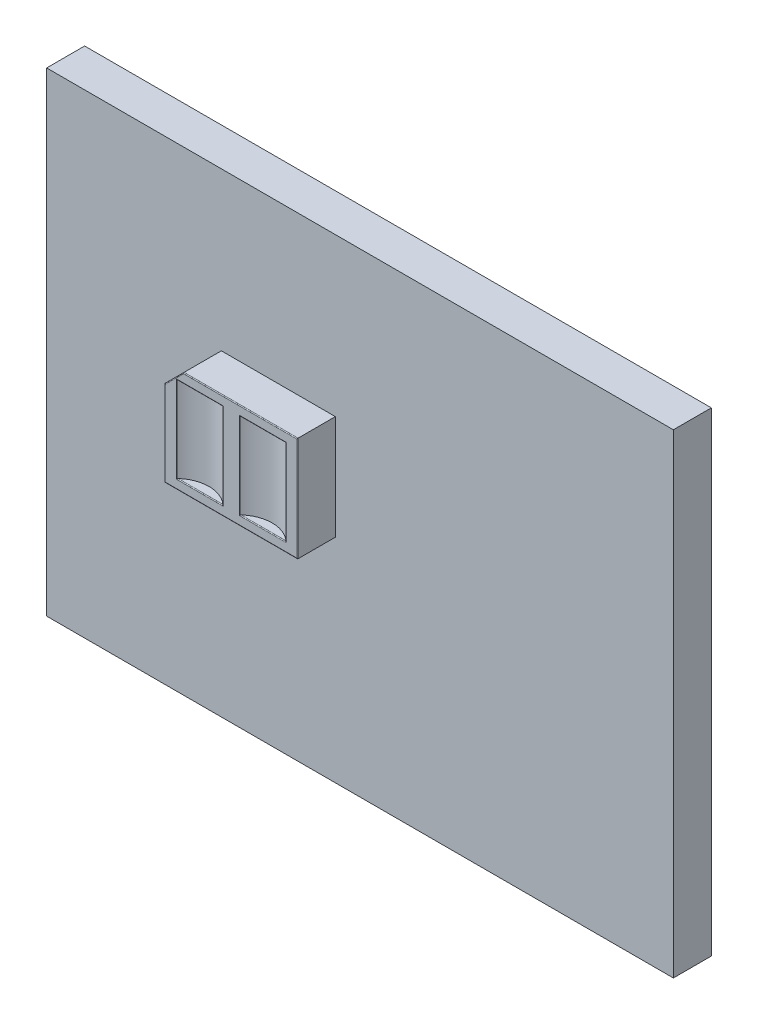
ISO-10303-21;
HEADER;
FILE_DESCRIPTION(('STEP AP214'),'2;1');
FILE_NAME('part.step','',(''),(''),'','','');
FILE_SCHEMA(('AUTOMOTIVE_DESIGN { 1 0 10303 214 1 1 1 1 }'));
ENDSEC;
DATA;
#1=APPLICATION_CONTEXT('core data for automotive mechanical design processes');
#2=APPLICATION_PROTOCOL_DEFINITION('international standard','automotive_design',2000,#1);
#3=PRODUCT_CONTEXT('',#1,'mechanical');
#4=PRODUCT('Part','Part','',(#3));
#5=PRODUCT_RELATED_PRODUCT_CATEGORY('part','',(#4));
#6=PRODUCT_DEFINITION_FORMATION('','',#4);
#7=PRODUCT_DEFINITION_CONTEXT('part definition',#1,'design');
#8=PRODUCT_DEFINITION('design','',#6,#7);
#9=PRODUCT_DEFINITION_SHAPE('','',#8);
#10=(LENGTH_UNIT() NAMED_UNIT(*) SI_UNIT(.MILLI.,.METRE.));
#11=(NAMED_UNIT(*) PLANE_ANGLE_UNIT() SI_UNIT($,.RADIAN.));
#12=(NAMED_UNIT(*) SI_UNIT($,.STERADIAN.) SOLID_ANGLE_UNIT());
#13=UNCERTAINTY_MEASURE_WITH_UNIT(LENGTH_MEASURE(1.E-05),#10,'distance_accuracy_value','');
#14=(GEOMETRIC_REPRESENTATION_CONTEXT(3) GLOBAL_UNCERTAINTY_ASSIGNED_CONTEXT((#13)) GLOBAL_UNIT_ASSIGNED_CONTEXT((#10,
#11,#12)) REPRESENTATION_CONTEXT('',''));
#15=CARTESIAN_POINT('',(0.,0.,0.));
#16=DIRECTION('',(0.,0.,1.));
#17=DIRECTION('',(1.,0.,0.));
#18=AXIS2_PLACEMENT_3D('',#15,#16,#17);
#19=CARTESIAN_POINT('',(-0.65,2.1,2.));
#20=DIRECTION('',(0.,0.,1.));
#21=DIRECTION('',(1.,0.,0.));
#22=AXIS2_PLACEMENT_3D('',#19,#20,#21);
#23=PLANE('',#22);
#24=DIRECTION('',(0.,1.,0.));
#25=VECTOR('',#24,1.);
#26=CARTESIAN_POINT('',(-2.59942700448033,-0.4,2.));
#27=LINE('',#26,#25);
#28=CARTESIAN_POINT('',(-2.59942700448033,1.87,2.));
#29=VERTEX_POINT('',#28);
#30=CARTESIAN_POINT('',(-2.59942700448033,-0.42,2.));
#31=VERTEX_POINT('',#30);
#32=EDGE_CURVE('E279',#29,#31,#27,.F.);
#33=ORIENTED_EDGE('',*,*,#32,.T.);
#34=DIRECTION('',(-1.,0.,0.));
#35=VECTOR('',#34,1.);
#36=CARTESIAN_POINT('',(-3.82761374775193,-0.42,2.));
#37=LINE('',#36,#35);
#38=CARTESIAN_POINT('',(-3.8355895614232,-0.42,2.));
#39=VERTEX_POINT('',#38);
#40=EDGE_CURVE('E281',#31,#39,#37,.T.);
#41=ORIENTED_EDGE('',*,*,#40,.T.);
#42=DIRECTION('',(0.,1.,0.));
#43=VECTOR('',#42,1.);
#44=CARTESIAN_POINT('',(-3.8355895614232,1.85,2.));
#45=LINE('',#44,#43);
#46=CARTESIAN_POINT('',(-3.8355895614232,1.87,2.));
#47=VERTEX_POINT('',#46);
#48=EDGE_CURVE('E275',#39,#47,#45,.T.);
#49=ORIENTED_EDGE('',*,*,#48,.T.);
#50=DIRECTION('',(-1.,0.,0.));
#51=VECTOR('',#50,1.);
#52=CARTESIAN_POINT('',(-0.65,1.87,2.));
#53=LINE('',#52,#51);
#54=EDGE_CURVE('E277',#47,#29,#53,.F.);
#55=ORIENTED_EDGE('',*,*,#54,.T.);
#56=EDGE_LOOP('',(#33,#41,#49,#55));
#57=FACE_BOUND('',#56,.T.);
#58=DIRECTION('',(0.,-1.,0.));
#59=VECTOR('',#58,1.);
#60=CARTESIAN_POINT('',(-4.13,-0.650000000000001,2.));
#61=LINE('',#60,#59);
#62=CARTESIAN_POINT('',(-4.13,1.59171572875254,2.));
#63=VERTEX_POINT('',#62);
#64=CARTESIAN_POINT('',(-4.13,-0.630000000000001,2.));
#65=VERTEX_POINT('',#64);
#66=EDGE_CURVE('E270',#63,#65,#61,.T.);
#67=ORIENTED_EDGE('',*,*,#66,.T.);
#68=DIRECTION('',(1.,0.,0.));
#69=VECTOR('',#68,1.);
#70=CARTESIAN_POINT('',(-0.65,-0.63,2.));
#71=LINE('',#70,#69);
#72=CARTESIAN_POINT('',(-0.67,-0.63,2.));
#73=VERTEX_POINT('',#72);
#74=EDGE_CURVE('E272',#65,#73,#71,.T.);
#75=ORIENTED_EDGE('',*,*,#74,.T.);
#76=DIRECTION('',(0.,1.,0.));
#77=VECTOR('',#76,1.);
#78=CARTESIAN_POINT('',(-0.67,2.1,2.));
#79=LINE('',#78,#77);
#80=CARTESIAN_POINT('',(-0.67,2.08,2.));
#81=VERTEX_POINT('',#80);
#82=EDGE_CURVE('E264',#73,#81,#79,.T.);
#83=ORIENTED_EDGE('',*,*,#82,.T.);
#84=DIRECTION('',(-1.,0.,0.));
#85=VECTOR('',#84,1.);
#86=CARTESIAN_POINT('',(-3.65,2.08,2.));
#87=LINE('',#86,#85);
#88=CARTESIAN_POINT('',(-3.64171572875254,2.08,2.));
#89=VERTEX_POINT('',#88);
#90=EDGE_CURVE('E266',#81,#89,#87,.T.);
#91=ORIENTED_EDGE('',*,*,#90,.T.);
#92=DIRECTION('',(-0.707106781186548,-0.707106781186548,0.));
#93=VECTOR('',#92,1.);
#94=CARTESIAN_POINT('',(-4.13585786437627,1.58585786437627,2.));
#95=LINE('',#94,#93);
#96=EDGE_CURVE('E268',#89,#63,#95,.T.);
#97=ORIENTED_EDGE('',*,*,#96,.T.);
#98=EDGE_LOOP('',(#67,#75,#83,#91,#97));
#99=FACE_BOUND('',#98,.T.);
#100=DIRECTION('',(-1.,0.,0.));
#101=VECTOR('',#100,1.);
#102=CARTESIAN_POINT('',(-0.65,-0.42,2.));
#103=LINE('',#102,#101);
#104=CARTESIAN_POINT('',(-0.940013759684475,-0.42,2.));
#105=VERTEX_POINT('',#104);
#106=CARTESIAN_POINT('',(-2.17617631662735,-0.42,2.));
#107=VERTEX_POINT('',#106);
#108=EDGE_CURVE('E259',#105,#107,#103,.T.);
#109=ORIENTED_EDGE('',*,*,#108,.T.);
#110=DIRECTION('',(0.,1.,0.));
#111=VECTOR('',#110,1.);
#112=CARTESIAN_POINT('',(-2.17617631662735,1.85,2.));
#113=LINE('',#112,#111);
#114=CARTESIAN_POINT('',(-2.17617631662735,1.87,2.));
#115=VERTEX_POINT('',#114);
#116=EDGE_CURVE('E261',#107,#115,#113,.T.);
#117=ORIENTED_EDGE('',*,*,#116,.T.);
#118=DIRECTION('',(-1.,0.,0.));
#119=VECTOR('',#118,1.);
#120=CARTESIAN_POINT('',(-0.947989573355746,1.87,2.));
#121=LINE('',#120,#119);
#122=CARTESIAN_POINT('',(-0.940013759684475,1.87,2.));
#123=VERTEX_POINT('',#122);
#124=EDGE_CURVE('E255',#115,#123,#121,.F.);
#125=ORIENTED_EDGE('',*,*,#124,.T.);
#126=DIRECTION('',(0.,1.,0.));
#127=VECTOR('',#126,1.);
#128=CARTESIAN_POINT('',(-0.940013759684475,-0.4,2.));
#129=LINE('',#128,#127);
#130=EDGE_CURVE('E257',#123,#105,#129,.F.);
#131=ORIENTED_EDGE('',*,*,#130,.T.);
#132=EDGE_LOOP('',(#109,#117,#125,#131));
#133=FACE_BOUND('',#132,.T.);
#134=ADVANCED_FACE('F31',(#57,#99,#133),#23,.T.);
#135=CARTESIAN_POINT('',(-8.25,-6.25,1.));
#136=DIRECTION('',(0.,0.,1.));
#137=DIRECTION('',(1.,0.,0.));
#138=AXIS2_PLACEMENT_3D('',#135,#136,#137);
#139=PLANE('',#138);
#140=DIRECTION('',(0.,-1.,0.));
#141=VECTOR('',#140,1.);
#142=CARTESIAN_POINT('',(-8.25,6.25,1.));
#143=LINE('',#142,#141);
#144=CARTESIAN_POINT('',(-8.25,6.25,1.));
#145=VERTEX_POINT('',#144);
#146=CARTESIAN_POINT('',(-8.25,-6.25,1.));
#147=VERTEX_POINT('',#146);
#148=EDGE_CURVE('E234',#145,#147,#143,.T.);
#149=ORIENTED_EDGE('',*,*,#148,.T.);
#150=DIRECTION('',(1.,0.,0.));
#151=VECTOR('',#150,1.);
#152=CARTESIAN_POINT('',(-8.25,-6.25,1.));
#153=LINE('',#152,#151);
#154=CARTESIAN_POINT('',(8.25,-6.25,1.));
#155=VERTEX_POINT('',#154);
#156=EDGE_CURVE('E237',#147,#155,#153,.T.);
#157=ORIENTED_EDGE('',*,*,#156,.T.);
#158=DIRECTION('',(0.,1.,0.));
#159=VECTOR('',#158,1.);
#160=CARTESIAN_POINT('',(8.25,6.25,1.));
#161=LINE('',#160,#159);
#162=CARTESIAN_POINT('',(8.25,6.25,1.));
#163=VERTEX_POINT('',#162);
#164=EDGE_CURVE('E239',#155,#163,#161,.T.);
#165=ORIENTED_EDGE('',*,*,#164,.T.);
#166=DIRECTION('',(-1.,0.,0.));
#167=VECTOR('',#166,1.);
#168=CARTESIAN_POINT('',(-8.25,6.25,1.));
#169=LINE('',#168,#167);
#170=EDGE_CURVE('E241',#163,#145,#169,.T.);
#171=ORIENTED_EDGE('',*,*,#170,.T.);
#172=EDGE_LOOP('',(#149,#157,#165,#171));
#173=FACE_BOUND('',#172,.T.);
#174=DIRECTION('',(1.,0.,0.));
#175=VECTOR('',#174,1.);
#176=CARTESIAN_POINT('',(-8.25,2.1,1.));
#177=LINE('',#176,#175);
#178=CARTESIAN_POINT('',(-3.65,2.1,1.));
#179=VERTEX_POINT('',#178);
#180=CARTESIAN_POINT('',(-0.65,2.1,1.));
#181=VERTEX_POINT('',#180);
#182=EDGE_CURVE('E219',#179,#181,#177,.T.);
#183=ORIENTED_EDGE('',*,*,#182,.T.);
#184=DIRECTION('',(0.,-1.,0.));
#185=VECTOR('',#184,1.);
#186=CARTESIAN_POINT('',(-0.65,-6.25,1.));
#187=LINE('',#186,#185);
#188=CARTESIAN_POINT('',(-0.65,-0.65,1.));
#189=VERTEX_POINT('',#188);
#190=EDGE_CURVE('E196',#181,#189,#187,.T.);
#191=ORIENTED_EDGE('',*,*,#190,.T.);
#192=DIRECTION('',(-1.,0.,0.));
#193=VECTOR('',#192,1.);
#194=CARTESIAN_POINT('',(-8.25,-0.650000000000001,1.));
#195=LINE('',#194,#193);
#196=CARTESIAN_POINT('',(-4.15,-0.650000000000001,1.));
#197=VERTEX_POINT('',#196);
#198=EDGE_CURVE('E207',#189,#197,#195,.T.);
#199=ORIENTED_EDGE('',*,*,#198,.T.);
#200=DIRECTION('',(0.,1.,0.));
#201=VECTOR('',#200,1.);
#202=CARTESIAN_POINT('',(-4.15,-6.25,1.));
#203=LINE('',#202,#201);
#204=CARTESIAN_POINT('',(-4.15,1.6,1.));
#205=VERTEX_POINT('',#204);
#206=EDGE_CURVE('E213',#197,#205,#203,.T.);
#207=ORIENTED_EDGE('',*,*,#206,.T.);
#208=DIRECTION('',(0.707106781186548,0.707106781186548,0.));
#209=VECTOR('',#208,1.);
#210=CARTESIAN_POINT('',(-10.125,-4.375,1.));
#211=LINE('',#210,#209);
#212=EDGE_CURVE('E225',#205,#179,#211,.T.);
#213=ORIENTED_EDGE('',*,*,#212,.T.);
#214=EDGE_LOOP('',(#183,#191,#199,#207,#213));
#215=FACE_BOUND('',#214,.T.);
#216=ADVANCED_FACE('F216',(#173,#215),#139,.T.);
#217=CARTESIAN_POINT('',(-8.25,6.25,1.));
#218=DIRECTION('',(1.,0.,0.));
#219=DIRECTION('',(0.,0.,-1.));
#220=AXIS2_PLACEMENT_3D('',#217,#218,#219);
#221=PLANE('',#220);
#222=DIRECTION('',(0.,-1.,0.));
#223=VECTOR('',#222,1.);
#224=CARTESIAN_POINT('',(-8.25,6.25,0.));
#225=LINE('',#224,#223);
#226=CARTESIAN_POINT('',(-8.25,6.25,0.));
#227=VERTEX_POINT('',#226);
#228=CARTESIAN_POINT('',(-8.25,-6.25,0.));
#229=VERTEX_POINT('',#228);
#230=EDGE_CURVE('E220',#227,#229,#225,.T.);
#231=ORIENTED_EDGE('',*,*,#230,.T.);
#232=DIRECTION('',(0.,0.,-1.));
#233=VECTOR('',#232,1.);
#234=CARTESIAN_POINT('',(-8.25,-6.25,1.));
#235=LINE('',#234,#233);
#236=EDGE_CURVE('E252',#147,#229,#235,.T.);
#237=ORIENTED_EDGE('',*,*,#236,.F.);
#238=ORIENTED_EDGE('',*,*,#148,.F.);
#239=DIRECTION('',(0.,0.,-1.));
#240=VECTOR('',#239,1.);
#241=CARTESIAN_POINT('',(-8.25,6.25,1.));
#242=LINE('',#241,#240);
#243=EDGE_CURVE('E243',#145,#227,#242,.T.);
#244=ORIENTED_EDGE('',*,*,#243,.T.);
#245=EDGE_LOOP('',(#231,#237,#238,#244));
#246=FACE_BOUND('',#245,.T.);
#247=ADVANCED_FACE('F33',(#246),#221,.F.);
#248=CARTESIAN_POINT('',(-8.25,-6.25,1.));
#249=DIRECTION('',(0.,1.,0.));
#250=DIRECTION('',(0.,0.,1.));
#251=AXIS2_PLACEMENT_3D('',#248,#249,#250);
#252=PLANE('',#251);
#253=DIRECTION('',(1.,0.,0.));
#254=VECTOR('',#253,1.);
#255=CARTESIAN_POINT('',(-8.25,-6.25,0.));
#256=LINE('',#255,#254);
#257=CARTESIAN_POINT('',(8.25,-6.25,0.));
#258=VERTEX_POINT('',#257);
#259=EDGE_CURVE('E223',#229,#258,#256,.T.);
#260=ORIENTED_EDGE('',*,*,#259,.T.);
#261=DIRECTION('',(0.,0.,-1.));
#262=VECTOR('',#261,1.);
#263=CARTESIAN_POINT('',(8.25,-6.25,1.));
#264=LINE('',#263,#262);
#265=EDGE_CURVE('E249',#155,#258,#264,.T.);
#266=ORIENTED_EDGE('',*,*,#265,.F.);
#267=ORIENTED_EDGE('',*,*,#156,.F.);
#268=ORIENTED_EDGE('',*,*,#236,.T.);
#269=EDGE_LOOP('',(#260,#266,#267,#268));
#270=FACE_BOUND('',#269,.T.);
#271=ADVANCED_FACE('F663',(#270),#252,.F.);
#272=CARTESIAN_POINT('',(8.25,6.25,1.));
#273=DIRECTION('',(-1.,0.,0.));
#274=DIRECTION('',(0.,0.,1.));
#275=AXIS2_PLACEMENT_3D('',#272,#273,#274);
#276=PLANE('',#275);
#277=DIRECTION('',(0.,1.,0.));
#278=VECTOR('',#277,1.);
#279=CARTESIAN_POINT('',(8.25,6.25,0.));
#280=LINE('',#279,#278);
#281=CARTESIAN_POINT('',(8.25,6.25,0.));
#282=VERTEX_POINT('',#281);
#283=EDGE_CURVE('E230',#258,#282,#280,.T.);
#284=ORIENTED_EDGE('',*,*,#283,.T.);
#285=DIRECTION('',(0.,0.,-1.));
#286=VECTOR('',#285,1.);
#287=CARTESIAN_POINT('',(8.25,6.25,1.));
#288=LINE('',#287,#286);
#289=EDGE_CURVE('E246',#163,#282,#288,.T.);
#290=ORIENTED_EDGE('',*,*,#289,.F.);
#291=ORIENTED_EDGE('',*,*,#164,.F.);
#292=ORIENTED_EDGE('',*,*,#265,.T.);
#293=EDGE_LOOP('',(#284,#290,#291,#292));
#294=FACE_BOUND('',#293,.T.);
#295=ADVANCED_FACE('F653',(#294),#276,.F.);
#296=CARTESIAN_POINT('',(-8.25,6.25,1.));
#297=DIRECTION('',(0.,-1.,0.));
#298=DIRECTION('',(0.,0.,-1.));
#299=AXIS2_PLACEMENT_3D('',#296,#297,#298);
#300=PLANE('',#299);
#301=DIRECTION('',(-1.,0.,0.));
#302=VECTOR('',#301,1.);
#303=CARTESIAN_POINT('',(-8.25,6.25,0.));
#304=LINE('',#303,#302);
#305=EDGE_CURVE('E232',#282,#227,#304,.T.);
#306=ORIENTED_EDGE('',*,*,#305,.T.);
#307=ORIENTED_EDGE('',*,*,#243,.F.);
#308=ORIENTED_EDGE('',*,*,#170,.F.);
#309=ORIENTED_EDGE('',*,*,#289,.T.);
#310=EDGE_LOOP('',(#306,#307,#308,#309));
#311=FACE_BOUND('',#310,.T.);
#312=ADVANCED_FACE('F635',(#311),#300,.F.);
#313=CARTESIAN_POINT('',(-8.25,-6.25,0.));
#314=DIRECTION('',(0.,0.,1.));
#315=DIRECTION('',(1.,0.,0.));
#316=AXIS2_PLACEMENT_3D('',#313,#314,#315);
#317=PLANE('',#316);
#318=ORIENTED_EDGE('',*,*,#230,.F.);
#319=ORIENTED_EDGE('',*,*,#305,.F.);
#320=ORIENTED_EDGE('',*,*,#283,.F.);
#321=ORIENTED_EDGE('',*,*,#259,.F.);
#322=EDGE_LOOP('',(#318,#319,#320,#321));
#323=FACE_BOUND('',#322,.T.);
#324=ADVANCED_FACE('F619',(#323),#317,.F.);
#325=CARTESIAN_POINT('',(-0.65,2.1,2.));
#326=DIRECTION('',(-1.,0.,0.));
#327=DIRECTION('',(0.,0.,1.));
#328=AXIS2_PLACEMENT_3D('',#325,#326,#327);
#329=PLANE('',#328);
#330=DIRECTION('',(0.,0.,-1.));
#331=VECTOR('',#330,1.);
#332=CARTESIAN_POINT('',(-0.65,2.1,2.));
#333=LINE('',#332,#331);
#334=CARTESIAN_POINT('',(-0.65,2.1,1.98));
#335=VERTEX_POINT('',#334);
#336=EDGE_CURVE('E214',#335,#181,#333,.T.);
#337=ORIENTED_EDGE('',*,*,#336,.F.);
#338=DIRECTION('',(0.,1.,0.));
#339=VECTOR('',#338,1.);
#340=CARTESIAN_POINT('',(-0.65,-0.65,1.98));
#341=LINE('',#340,#339);
#342=CARTESIAN_POINT('',(-0.65,-0.65,1.98));
#343=VERTEX_POINT('',#342);
#344=EDGE_CURVE('E199',#335,#343,#341,.F.);
#345=ORIENTED_EDGE('',*,*,#344,.T.);
#346=DIRECTION('',(0.,0.,-1.));
#347=VECTOR('',#346,1.);
#348=CARTESIAN_POINT('',(-0.65,-0.65,2.));
#349=LINE('',#348,#347);
#350=EDGE_CURVE('E191',#343,#189,#349,.T.);
#351=ORIENTED_EDGE('',*,*,#350,.T.);
#352=ORIENTED_EDGE('',*,*,#190,.F.);
#353=EDGE_LOOP('',(#337,#345,#351,#352));
#354=FACE_BOUND('',#353,.T.);
#355=ADVANCED_FACE('F194',(#354),#329,.F.);
#356=CARTESIAN_POINT('',(-3.65,2.1,2.));
#357=DIRECTION('',(0.,-1.,0.));
#358=DIRECTION('',(0.,0.,-1.));
#359=AXIS2_PLACEMENT_3D('',#356,#357,#358);
#360=PLANE('',#359);
#361=DIRECTION('',(0.,0.,-1.));
#362=VECTOR('',#361,1.);
#363=CARTESIAN_POINT('',(-3.65,2.1,2.));
#364=LINE('',#363,#362);
#365=CARTESIAN_POINT('',(-3.65,2.1,1.98));
#366=VERTEX_POINT('',#365);
#367=EDGE_CURVE('E450',#366,#179,#364,.T.);
#368=ORIENTED_EDGE('',*,*,#367,.F.);
#369=DIRECTION('',(-1.,0.,0.));
#370=VECTOR('',#369,1.);
#371=CARTESIAN_POINT('',(-0.65,2.1,1.98));
#372=LINE('',#371,#370);
#373=EDGE_CURVE('E299',#366,#335,#372,.F.);
#374=ORIENTED_EDGE('',*,*,#373,.T.);
#375=ORIENTED_EDGE('',*,*,#336,.T.);
#376=ORIENTED_EDGE('',*,*,#182,.F.);
#377=EDGE_LOOP('',(#368,#374,#375,#376));
#378=FACE_BOUND('',#377,.T.);
#379=ADVANCED_FACE('F461',(#378),#360,.F.);
#380=CARTESIAN_POINT('',(-4.15,1.6,2.));
#381=DIRECTION('',(0.707106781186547,-0.707106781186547,0.));
#382=DIRECTION('',(0.707106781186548,0.707106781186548,0.));
#383=AXIS2_PLACEMENT_3D('',#380,#381,#382);
#384=PLANE('',#383);
#385=DIRECTION('',(0.,0.,-1.));
#386=VECTOR('',#385,1.);
#387=CARTESIAN_POINT('',(-4.15,1.6,2.));
#388=LINE('',#387,#386);
#389=CARTESIAN_POINT('',(-4.15,1.6,1.98));
#390=VERTEX_POINT('',#389);
#391=EDGE_CURVE('E448',#390,#205,#388,.T.);
#392=ORIENTED_EDGE('',*,*,#391,.F.);
#393=DIRECTION('',(-0.707106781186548,-0.707106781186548,0.));
#394=VECTOR('',#393,1.);
#395=CARTESIAN_POINT('',(-3.65,2.1,1.98));
#396=LINE('',#395,#394);
#397=EDGE_CURVE('E297',#390,#366,#396,.F.);
#398=ORIENTED_EDGE('',*,*,#397,.T.);
#399=ORIENTED_EDGE('',*,*,#367,.T.);
#400=ORIENTED_EDGE('',*,*,#212,.F.);
#401=EDGE_LOOP('',(#392,#398,#399,#400));
#402=FACE_BOUND('',#401,.T.);
#403=ADVANCED_FACE('F456',(#402),#384,.F.);
#404=CARTESIAN_POINT('',(-4.15,-0.650000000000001,2.));
#405=DIRECTION('',(1.,0.,0.));
#406=DIRECTION('',(0.,0.,-1.));
#407=AXIS2_PLACEMENT_3D('',#404,#405,#406);
#408=PLANE('',#407);
#409=DIRECTION('',(0.,0.,-1.));
#410=VECTOR('',#409,1.);
#411=CARTESIAN_POINT('',(-4.15,-0.650000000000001,2.));
#412=LINE('',#411,#410);
#413=CARTESIAN_POINT('',(-4.15,-0.650000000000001,1.98));
#414=VERTEX_POINT('',#413);
#415=EDGE_CURVE('E203',#414,#197,#412,.T.);
#416=ORIENTED_EDGE('',*,*,#415,.F.);
#417=DIRECTION('',(0.,-1.,0.));
#418=VECTOR('',#417,1.);
#419=CARTESIAN_POINT('',(-4.15,1.6,1.98));
#420=LINE('',#419,#418);
#421=EDGE_CURVE('E295',#414,#390,#420,.F.);
#422=ORIENTED_EDGE('',*,*,#421,.T.);
#423=ORIENTED_EDGE('',*,*,#391,.T.);
#424=ORIENTED_EDGE('',*,*,#206,.F.);
#425=EDGE_LOOP('',(#416,#422,#423,#424));
#426=FACE_BOUND('',#425,.T.);
#427=ADVANCED_FACE('F477',(#426),#408,.F.);
#428=CARTESIAN_POINT('',(-0.65,-0.65,2.));
#429=DIRECTION('',(0.,1.,0.));
#430=DIRECTION('',(-1.,0.,0.));
#431=AXIS2_PLACEMENT_3D('',#428,#429,#430);
#432=PLANE('',#431);
#433=ORIENTED_EDGE('',*,*,#350,.F.);
#434=DIRECTION('',(1.,0.,0.));
#435=VECTOR('',#434,1.);
#436=CARTESIAN_POINT('',(-4.15,-0.650000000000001,1.98));
#437=LINE('',#436,#435);
#438=EDGE_CURVE('E293',#343,#414,#437,.F.);
#439=ORIENTED_EDGE('',*,*,#438,.T.);
#440=ORIENTED_EDGE('',*,*,#415,.T.);
#441=ORIENTED_EDGE('',*,*,#198,.F.);
#442=EDGE_LOOP('',(#433,#439,#440,#441));
#443=FACE_BOUND('',#442,.T.);
#444=ADVANCED_FACE('F208',(#443),#432,.F.);
#445=CARTESIAN_POINT('',(-3.21750828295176,1.85,2.63752959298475));
#446=DIRECTION('',(0.,-1.,0.));
#447=DIRECTION('',(0.,0.,-1.));
#448=AXIS2_PLACEMENT_3D('',#445,#446,#447);
#449=CYLINDRICAL_SURFACE('',#448,0.882424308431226);
#450=CARTESIAN_POINT('',(-2.62901232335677,-0.4,1.98));
#451=CARTESIAN_POINT('',(-2.6272001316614,-0.400004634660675,1.981621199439));
#452=CARTESIAN_POINT('',(-2.62538571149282,-0.400198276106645,1.98325934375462));
#453=CARTESIAN_POINT('',(-2.62187863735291,-0.40099829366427,1.98645110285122));
#454=CARTESIAN_POINT('',(-2.62018395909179,-0.40159196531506,1.98800577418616));
#455=CARTESIAN_POINT('',(-2.61759664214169,-0.402885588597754,1.99039714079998));
#456=CARTESIAN_POINT('',(-2.61666159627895,-0.403440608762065,1.99126539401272));
#457=CARTESIAN_POINT('',(-2.6148428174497,-0.404730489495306,1.99296106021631));
#458=CARTESIAN_POINT('',(-2.61396033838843,-0.405468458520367,1.99378743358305));
#459=CARTESIAN_POINT('',(-2.61312524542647,-0.406301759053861,1.9945725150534));
#460=B_SPLINE_CURVE_WITH_KNOTS('',3,(#450,#451,#452,#453,#454,#455,#456,#457,#458,#459),
.UNSPECIFIED.,.F.,.F.,(4,2,2,2,4),(0.,0.00730858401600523,0.0143953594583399,0.0185579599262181,
0.0227968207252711),.UNSPECIFIED.);
#461=CARTESIAN_POINT('',(-2.62901232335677,-0.4,1.98));
#462=VERTEX_POINT('',#461);
#463=CARTESIAN_POINT('',(-2.61312524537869,-0.406301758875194,1.99457251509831));
#464=VERTEX_POINT('',#463);
#465=EDGE_CURVE('E316',#462,#464,#460,.T.);
#466=ORIENTED_EDGE('',*,*,#465,.T.);
#467=DIRECTION('',(0.,-1.,0.));
#468=VECTOR('',#467,1.);
#469=CARTESIAN_POINT('',(-2.61312524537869,1.85,1.99457251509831));
#470=LINE('',#469,#468);
#471=CARTESIAN_POINT('',(-2.61312524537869,1.85630175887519,1.99457251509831));
#472=VERTEX_POINT('',#471);
#473=EDGE_CURVE('E289',#464,#472,#470,.F.);
#474=ORIENTED_EDGE('',*,*,#473,.T.);
#475=CARTESIAN_POINT('',(-2.61312524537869,1.85630175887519,1.99457251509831));
#476=CARTESIAN_POINT('',(-2.61414134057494,1.85528984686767,1.99361714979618));
#477=CARTESIAN_POINT('',(-2.61522530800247,1.85441776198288,1.99260297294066));
#478=CARTESIAN_POINT('',(-2.61746513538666,1.85294195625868,1.99051869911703));
#479=CARTESIAN_POINT('',(-2.61861900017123,1.85233296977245,1.98945022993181));
#480=CARTESIAN_POINT('',(-2.62125844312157,1.85121416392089,1.98702000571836));
#481=CARTESIAN_POINT('',(-2.62275825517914,1.85076127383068,1.98564833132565));
#482=CARTESIAN_POINT('',(-2.62584154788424,1.85015153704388,1.98284822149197));
#483=CARTESIAN_POINT('',(-2.62742619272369,1.8500028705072,1.98141924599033));
#484=CARTESIAN_POINT('',(-2.62901232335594,1.84999999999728,1.98000000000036));
#485=B_SPLINE_CURVE_WITH_KNOTS('',3,(#475,#476,#477,#478,#479,#480,#481,#482,#483,#484),
.UNSPECIFIED.,.F.,.F.,(4,2,2,2,4),(0.,0.00514761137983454,0.0101867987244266,0.0164101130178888,
0.0227986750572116),.UNSPECIFIED.);
#486=CARTESIAN_POINT('',(-2.62901232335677,1.85,1.98));
#487=VERTEX_POINT('',#486);
#488=EDGE_CURVE('E355',#472,#487,#485,.T.);
#489=ORIENTED_EDGE('',*,*,#488,.T.);
#490=CARTESIAN_POINT('',(-3.21750828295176,1.85,2.63752959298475));
#491=DIRECTION('',(0.,-1.,0.));
#492=DIRECTION('',(0.,0.,-1.));
#493=AXIS2_PLACEMENT_3D('',#490,#491,#492);
#494=CIRCLE('',#493,0.882424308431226);
#495=CARTESIAN_POINT('',(-3.80600424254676,1.85,1.98));
#496=VERTEX_POINT('',#495);
#497=EDGE_CURVE('E204',#496,#487,#494,.T.);
#498=ORIENTED_EDGE('',*,*,#497,.F.);
#499=CARTESIAN_POINT('',(-3.80600424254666,1.85,1.97999999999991));
#500=CARTESIAN_POINT('',(-3.80781643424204,1.85000463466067,1.98162119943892));
#501=CARTESIAN_POINT('',(-3.80963085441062,1.85019827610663,1.98325934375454));
#502=CARTESIAN_POINT('',(-3.81313792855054,1.85099829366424,1.98645110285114));
#503=CARTESIAN_POINT('',(-3.81483260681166,1.85159196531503,1.98800577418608));
#504=CARTESIAN_POINT('',(-3.81741992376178,1.85288558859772,1.99039714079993));
#505=CARTESIAN_POINT('',(-3.81835496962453,1.85344060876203,1.99126539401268));
#506=CARTESIAN_POINT('',(-3.8201737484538,1.85473048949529,1.99296106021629));
#507=CARTESIAN_POINT('',(-3.82105622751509,1.85546845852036,1.99378743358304));
#508=CARTESIAN_POINT('',(-3.82189132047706,1.85630175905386,1.9945725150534));
#509=B_SPLINE_CURVE_WITH_KNOTS('',3,(#499,#500,#501,#502,#503,#504,#505,#506,#507,#508),
.UNSPECIFIED.,.F.,.F.,(4,2,2,2,4),(0.,0.00730858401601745,0.0143953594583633,0.0185579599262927,
0.0227968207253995),.UNSPECIFIED.);
#510=CARTESIAN_POINT('',(-3.82189132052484,1.85630175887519,1.99457251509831));
#511=VERTEX_POINT('',#510);
#512=EDGE_CURVE('E350',#496,#511,#509,.T.);
#513=ORIENTED_EDGE('',*,*,#512,.T.);
#514=DIRECTION('',(0.,-1.,0.));
#515=VECTOR('',#514,1.);
#516=CARTESIAN_POINT('',(-3.82189132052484,1.85,1.99457251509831));
#517=LINE('',#516,#515);
#518=CARTESIAN_POINT('',(-3.82189132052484,-0.406301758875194,1.99457251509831));
#519=VERTEX_POINT('',#518);
#520=EDGE_CURVE('E287',#511,#519,#517,.T.);
#521=ORIENTED_EDGE('',*,*,#520,.T.);
#522=CARTESIAN_POINT('',(-3.82189132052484,-0.406301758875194,1.99457251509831));
#523=CARTESIAN_POINT('',(-3.82087522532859,-0.405289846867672,1.99361714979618));
#524=CARTESIAN_POINT('',(-3.81979125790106,-0.404417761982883,1.99260297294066));
#525=CARTESIAN_POINT('',(-3.81755143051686,-0.402941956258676,1.99051869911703));
#526=CARTESIAN_POINT('',(-3.8163975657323,-0.402332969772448,1.98945022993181));
#527=CARTESIAN_POINT('',(-3.81375812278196,-0.401214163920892,1.98702000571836));
#528=CARTESIAN_POINT('',(-3.81225831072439,-0.400761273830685,1.98564833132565));
#529=CARTESIAN_POINT('',(-3.80917501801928,-0.400151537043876,1.98284822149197));
#530=CARTESIAN_POINT('',(-3.80759037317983,-0.4000028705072,1.98141924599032));
#531=CARTESIAN_POINT('',(-3.80600424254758,-0.399999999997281,1.98000000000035));
#532=B_SPLINE_CURVE_WITH_KNOTS('',3,(#522,#523,#524,#525,#526,#527,#528,#529,#530,#531),
.UNSPECIFIED.,.F.,.F.,(4,2,2,2,4),(0.,0.00514761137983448,0.0101867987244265,0.0164101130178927,
0.0227986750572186),.UNSPECIFIED.);
#533=CARTESIAN_POINT('',(-3.80600424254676,-0.4,1.98));
#534=VERTEX_POINT('',#533);
#535=EDGE_CURVE('E309',#519,#534,#532,.T.);
#536=ORIENTED_EDGE('',*,*,#535,.T.);
#537=CARTESIAN_POINT('',(-3.21750828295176,-0.4,2.63752959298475));
#538=DIRECTION('',(0.,-1.,0.));
#539=DIRECTION('',(0.,0.,-1.));
#540=AXIS2_PLACEMENT_3D('',#537,#538,#539);
#541=CIRCLE('',#540,0.882424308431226);
#542=EDGE_CURVE('E442',#534,#462,#541,.T.);
#543=ORIENTED_EDGE('',*,*,#542,.T.);
#544=EDGE_LOOP('',(#466,#474,#489,#498,#513,#521,#536,#543));
#545=FACE_BOUND('',#544,.T.);
#546=ADVANCED_FACE('F321',(#545),#449,.F.);
#547=CARTESIAN_POINT('',(-3.21750828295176,1.85,2.63752959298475));
#548=DIRECTION('',(0.,-1.,0.));
#549=DIRECTION('',(0.,0.,-1.));
#550=AXIS2_PLACEMENT_3D('',#547,#548,#549);
#551=PLANE('',#550);
#552=ORIENTED_EDGE('',*,*,#497,.T.);
#553=DIRECTION('',(-1.,0.,0.));
#554=VECTOR('',#553,1.);
#555=CARTESIAN_POINT('',(-3.21750828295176,1.85,1.98));
#556=LINE('',#555,#554);
#557=EDGE_CURVE('E291',#487,#496,#556,.T.);
#558=ORIENTED_EDGE('',*,*,#557,.T.);
#559=EDGE_LOOP('',(#552,#558));
#560=FACE_BOUND('',#559,.T.);
#561=ADVANCED_FACE('F561',(#560),#551,.T.);
#562=CARTESIAN_POINT('',(-3.21750828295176,-0.4,2.63752959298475));
#563=DIRECTION('',(0.,-1.,0.));
#564=DIRECTION('',(0.,0.,-1.));
#565=AXIS2_PLACEMENT_3D('',#562,#563,#564);
#566=PLANE('',#565);
#567=ORIENTED_EDGE('',*,*,#542,.F.);
#568=DIRECTION('',(-1.,0.,0.));
#569=VECTOR('',#568,1.);
#570=CARTESIAN_POINT('',(-2.6074028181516,-0.4,1.98));
#571=LINE('',#570,#569);
#572=EDGE_CURVE('E284',#534,#462,#571,.F.);
#573=ORIENTED_EDGE('',*,*,#572,.T.);
#574=EDGE_LOOP('',(#567,#573));
#575=FACE_BOUND('',#574,.T.);
#576=ADVANCED_FACE('F503',(#575),#566,.F.);
#577=CARTESIAN_POINT('',(-1.55809503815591,1.85,2.63752959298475));
#578=DIRECTION('',(0.,-1.,0.));
#579=DIRECTION('',(0.,0.,-1.));
#580=AXIS2_PLACEMENT_3D('',#577,#578,#579);
#581=CYLINDRICAL_SURFACE('',#580,0.882424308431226);
#582=CARTESIAN_POINT('',(-1.55809503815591,1.85,2.63752959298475));
#583=DIRECTION('',(0.,-1.,0.));
#584=DIRECTION('',(0.,0.,1.));
#585=AXIS2_PLACEMENT_3D('',#582,#583,#584);
#586=CIRCLE('',#585,0.882424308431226);
#587=CARTESIAN_POINT('',(-2.14659099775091,1.85,1.98));
#588=VERTEX_POINT('',#587);
#589=CARTESIAN_POINT('',(-0.969599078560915,1.85,1.98));
#590=VERTEX_POINT('',#589);
#591=EDGE_CURVE('E439',#588,#590,#586,.T.);
#592=ORIENTED_EDGE('',*,*,#591,.F.);
#593=CARTESIAN_POINT('',(-2.14659099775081,1.85,1.97999999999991));
#594=CARTESIAN_POINT('',(-2.14840318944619,1.85000463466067,1.98162119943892));
#595=CARTESIAN_POINT('',(-2.15021760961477,1.85019827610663,1.98325934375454));
#596=CARTESIAN_POINT('',(-2.15372468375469,1.85099829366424,1.98645110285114));
#597=CARTESIAN_POINT('',(-2.1554193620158,1.85159196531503,1.98800577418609));
#598=CARTESIAN_POINT('',(-2.15800667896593,1.85288558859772,1.99039714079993));
#599=CARTESIAN_POINT('',(-2.15894172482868,1.85344060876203,1.99126539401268));
#600=CARTESIAN_POINT('',(-2.16076050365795,1.85473048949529,1.99296106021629));
#601=CARTESIAN_POINT('',(-2.16164298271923,1.85546845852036,1.99378743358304));
#602=CARTESIAN_POINT('',(-2.16247807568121,1.85630175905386,1.9945725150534));
#603=B_SPLINE_CURVE_WITH_KNOTS('',3,(#593,#594,#595,#596,#597,#598,#599,#600,#601,#602),
.UNSPECIFIED.,.F.,.F.,(4,2,2,2,4),(0.,0.0073085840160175,0.0143953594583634,0.0185579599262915,
0.022796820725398),.UNSPECIFIED.);
#604=CARTESIAN_POINT('',(-2.16247807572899,1.85630175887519,1.99457251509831));
#605=VERTEX_POINT('',#604);
#606=EDGE_CURVE('E44',#588,#605,#603,.T.);
#607=ORIENTED_EDGE('',*,*,#606,.T.);
#608=DIRECTION('',(0.,-1.,0.));
#609=VECTOR('',#608,1.);
#610=CARTESIAN_POINT('',(-2.16247807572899,1.85,1.99457251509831));
#611=LINE('',#610,#609);
#612=CARTESIAN_POINT('',(-2.16247807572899,-0.406301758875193,1.99457251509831));
#613=VERTEX_POINT('',#612);
#614=EDGE_CURVE('E303',#605,#613,#611,.T.);
#615=ORIENTED_EDGE('',*,*,#614,.T.);
#616=CARTESIAN_POINT('',(-2.16247807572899,-0.406301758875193,1.99457251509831));
#617=CARTESIAN_POINT('',(-2.16146198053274,-0.405289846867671,1.99361714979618));
#618=CARTESIAN_POINT('',(-2.16037801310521,-0.404417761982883,1.99260297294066));
#619=CARTESIAN_POINT('',(-2.15813818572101,-0.402941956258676,1.99051869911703));
#620=CARTESIAN_POINT('',(-2.15698432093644,-0.402332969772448,1.98945022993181));
#621=CARTESIAN_POINT('',(-2.15434487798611,-0.401214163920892,1.98702000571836));
#622=CARTESIAN_POINT('',(-2.15284506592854,-0.400761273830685,1.98564833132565));
#623=CARTESIAN_POINT('',(-2.14976177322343,-0.400151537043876,1.98284822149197));
#624=CARTESIAN_POINT('',(-2.14817712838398,-0.4000028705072,1.98141924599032));
#625=CARTESIAN_POINT('',(-2.14659099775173,-0.399999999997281,1.98000000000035));
#626=B_SPLINE_CURVE_WITH_KNOTS('',3,(#616,#617,#618,#619,#620,#621,#622,#623,#624,#625),
.UNSPECIFIED.,.F.,.F.,(4,2,2,2,4),(0.,0.00514761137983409,0.0101867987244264,0.016410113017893,
0.022798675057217),.UNSPECIFIED.);
#627=CARTESIAN_POINT('',(-2.14659099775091,-0.4,1.98));
#628=VERTEX_POINT('',#627);
#629=EDGE_CURVE('E360',#613,#628,#626,.T.);
#630=ORIENTED_EDGE('',*,*,#629,.T.);
#631=CARTESIAN_POINT('',(-1.55809503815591,-0.4,2.63752959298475));
#632=DIRECTION('',(0.,-1.,0.));
#633=DIRECTION('',(0.,0.,1.));
#634=AXIS2_PLACEMENT_3D('',#631,#632,#633);
#635=CIRCLE('',#634,0.882424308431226);
#636=CARTESIAN_POINT('',(-0.969599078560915,-0.4,1.98));
#637=VERTEX_POINT('',#636);
#638=EDGE_CURVE('E399',#628,#637,#635,.T.);
#639=ORIENTED_EDGE('',*,*,#638,.T.);
#640=CARTESIAN_POINT('',(-0.969599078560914,-0.4,1.98));
#641=CARTESIAN_POINT('',(-0.967786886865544,-0.400004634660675,1.981621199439));
#642=CARTESIAN_POINT('',(-0.965972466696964,-0.400198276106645,1.98325934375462));
#643=CARTESIAN_POINT('',(-0.962465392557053,-0.40099829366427,1.98645110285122));
#644=CARTESIAN_POINT('',(-0.960770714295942,-0.40159196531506,1.98800577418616));
#645=CARTESIAN_POINT('',(-0.958183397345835,-0.402885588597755,1.99039714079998));
#646=CARTESIAN_POINT('',(-0.957248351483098,-0.403440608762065,1.99126539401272));
#647=CARTESIAN_POINT('',(-0.95542957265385,-0.404730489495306,1.99296106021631));
#648=CARTESIAN_POINT('',(-0.954547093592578,-0.405468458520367,1.99378743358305));
#649=CARTESIAN_POINT('',(-0.953712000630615,-0.406301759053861,1.9945725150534));
#650=B_SPLINE_CURVE_WITH_KNOTS('',3,(#640,#641,#642,#643,#644,#645,#646,#647,#648,#649),
.UNSPECIFIED.,.F.,.F.,(4,2,2,2,4),(0.,0.00730858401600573,0.0143953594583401,0.0185579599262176,
0.0227968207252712),.UNSPECIFIED.);
#651=CARTESIAN_POINT('',(-0.953712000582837,-0.406301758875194,1.99457251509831));
#652=VERTEX_POINT('',#651);
#653=EDGE_CURVE('E366',#637,#652,#650,.T.);
#654=ORIENTED_EDGE('',*,*,#653,.T.);
#655=DIRECTION('',(0.,-1.,0.));
#656=VECTOR('',#655,1.);
#657=CARTESIAN_POINT('',(-0.953712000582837,1.85,1.99457251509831));
#658=LINE('',#657,#656);
#659=CARTESIAN_POINT('',(-0.953712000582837,1.85630175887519,1.99457251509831));
#660=VERTEX_POINT('',#659);
#661=EDGE_CURVE('E50',#652,#660,#658,.F.);
#662=ORIENTED_EDGE('',*,*,#661,.T.);
#663=CARTESIAN_POINT('',(-0.953712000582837,1.85630175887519,1.99457251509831));
#664=CARTESIAN_POINT('',(-0.954728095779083,1.85528984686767,1.99361714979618));
#665=CARTESIAN_POINT('',(-0.955812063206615,1.85441776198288,1.99260297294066));
#666=CARTESIAN_POINT('',(-0.958051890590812,1.85294195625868,1.99051869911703));
#667=CARTESIAN_POINT('',(-0.959205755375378,1.85233296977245,1.98945022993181));
#668=CARTESIAN_POINT('',(-0.961845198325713,1.85121416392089,1.98702000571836));
#669=CARTESIAN_POINT('',(-0.963345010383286,1.85076127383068,1.98564833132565));
#670=CARTESIAN_POINT('',(-0.966428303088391,1.85015153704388,1.98284822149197));
#671=CARTESIAN_POINT('',(-0.968012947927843,1.8500028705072,1.98141924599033));
#672=CARTESIAN_POINT('',(-0.96959907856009,1.84999999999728,1.98000000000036));
#673=B_SPLINE_CURVE_WITH_KNOTS('',3,(#663,#664,#665,#666,#667,#668,#669,#670,#671,#672),
.UNSPECIFIED.,.F.,.F.,(4,2,2,2,4),(0.,0.0051476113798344,0.0101867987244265,0.0164101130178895,
0.0227986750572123),.UNSPECIFIED.);
#674=EDGE_CURVE('E11',#660,#590,#673,.T.);
#675=ORIENTED_EDGE('',*,*,#674,.T.);
#676=EDGE_LOOP('',(#592,#607,#615,#630,#639,#654,#662,#675));
#677=FACE_BOUND('',#676,.T.);
#678=ADVANCED_FACE('F370',(#677),#581,.F.);
#679=CARTESIAN_POINT('',(-1.55809503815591,1.85,2.63752959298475));
#680=DIRECTION('',(0.,1.,0.));
#681=DIRECTION('',(0.,0.,1.));
#682=AXIS2_PLACEMENT_3D('',#679,#680,#681);
#683=PLANE('',#682);
#684=ORIENTED_EDGE('',*,*,#591,.T.);
#685=DIRECTION('',(-1.,0.,0.));
#686=VECTOR('',#685,1.);
#687=CARTESIAN_POINT('',(-2.16820050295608,1.85,1.98));
#688=LINE('',#687,#686);
#689=EDGE_CURVE('E307',#590,#588,#688,.T.);
#690=ORIENTED_EDGE('',*,*,#689,.T.);
#691=EDGE_LOOP('',(#684,#690));
#692=FACE_BOUND('',#691,.T.);
#693=ADVANCED_FACE('F495',(#692),#683,.F.);
#694=CARTESIAN_POINT('',(-1.55809503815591,-0.4,2.63752959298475));
#695=DIRECTION('',(0.,1.,0.));
#696=DIRECTION('',(0.,0.,1.));
#697=AXIS2_PLACEMENT_3D('',#694,#695,#696);
#698=PLANE('',#697);
#699=ORIENTED_EDGE('',*,*,#638,.F.);
#700=DIRECTION('',(-1.,0.,0.));
#701=VECTOR('',#700,1.);
#702=CARTESIAN_POINT('',(-1.55809503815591,-0.4,1.98));
#703=LINE('',#702,#701);
#704=EDGE_CURVE('E305',#628,#637,#703,.F.);
#705=ORIENTED_EDGE('',*,*,#704,.T.);
#706=EDGE_LOOP('',(#699,#705));
#707=FACE_BOUND('',#706,.T.);
#708=ADVANCED_FACE('F346',(#707),#698,.T.);
#709=CARTESIAN_POINT('',(-3.21750828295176,1.87,1.98));
#710=DIRECTION('',(-1.,0.,0.));
#711=DIRECTION('',(0.,0.,1.));
#712=AXIS2_PLACEMENT_3D('',#709,#710,#711);
#713=CYLINDRICAL_SURFACE('',#712,0.02);
#714=ORIENTED_EDGE('',*,*,#557,.F.);
#715=ORIENTED_EDGE('',*,*,#488,.F.);
#716=CARTESIAN_POINT('',(-2.59942700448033,1.87,1.98));
#717=DIRECTION('',(0.707106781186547,-0.707106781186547,0.));
#718=DIRECTION('',(-0.707106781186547,-0.707106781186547,0.));
#719=AXIS2_PLACEMENT_3D('',#716,#717,#718);
#720=ELLIPSE('',#719,0.0282842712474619,0.02);
#721=EDGE_CURVE('E435',#29,#472,#720,.T.);
#722=ORIENTED_EDGE('',*,*,#721,.F.);
#723=ORIENTED_EDGE('',*,*,#54,.F.);
#724=CARTESIAN_POINT('',(-3.8355895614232,1.87,1.98));
#725=DIRECTION('',(-0.707106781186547,-0.707106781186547,0.));
#726=DIRECTION('',(-0.707106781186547,0.707106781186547,0.));
#727=AXIS2_PLACEMENT_3D('',#724,#725,#726);
#728=ELLIPSE('',#727,0.0282842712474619,0.02);
#729=EDGE_CURVE('E432',#511,#47,#728,.T.);
#730=ORIENTED_EDGE('',*,*,#729,.F.);
#731=ORIENTED_EDGE('',*,*,#512,.F.);
#732=EDGE_LOOP('',(#714,#715,#722,#723,#730,#731));
#733=FACE_BOUND('',#732,.T.);
#734=ADVANCED_FACE('F341',(#733),#713,.T.);
#735=CARTESIAN_POINT('',(-2.59942700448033,1.85,1.98));
#736=DIRECTION('',(0.,-1.,0.));
#737=DIRECTION('',(0.,0.,-1.));
#738=AXIS2_PLACEMENT_3D('',#735,#736,#737);
#739=CYLINDRICAL_SURFACE('',#738,0.02);
#740=ORIENTED_EDGE('',*,*,#473,.F.);
#741=CARTESIAN_POINT('',(-2.59942700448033,-0.42,1.98));
#742=DIRECTION('',(0.707106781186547,0.707106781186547,0.));
#743=DIRECTION('',(0.707106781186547,-0.707106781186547,0.));
#744=AXIS2_PLACEMENT_3D('',#741,#742,#743);
#745=ELLIPSE('',#744,0.0282842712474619,0.02);
#746=EDGE_CURVE('E429',#31,#464,#745,.F.);
#747=ORIENTED_EDGE('',*,*,#746,.F.);
#748=ORIENTED_EDGE('',*,*,#32,.F.);
#749=ORIENTED_EDGE('',*,*,#721,.T.);
#750=EDGE_LOOP('',(#740,#747,#748,#749));
#751=FACE_BOUND('',#750,.T.);
#752=ADVANCED_FACE('F337',(#751),#739,.T.);
#753=CARTESIAN_POINT('',(-3.8355895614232,1.85,1.98));
#754=DIRECTION('',(0.,-1.,0.));
#755=DIRECTION('',(0.,0.,-1.));
#756=AXIS2_PLACEMENT_3D('',#753,#754,#755);
#757=CYLINDRICAL_SURFACE('',#756,0.02);
#758=ORIENTED_EDGE('',*,*,#729,.T.);
#759=ORIENTED_EDGE('',*,*,#48,.F.);
#760=CARTESIAN_POINT('',(-3.8355895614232,-0.42,1.98));
#761=DIRECTION('',(0.707106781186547,-0.707106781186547,0.));
#762=DIRECTION('',(0.707106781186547,0.707106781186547,0.));
#763=AXIS2_PLACEMENT_3D('',#760,#761,#762);
#764=ELLIPSE('',#763,0.0282842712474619,0.02);
#765=EDGE_CURVE('E427',#519,#39,#764,.T.);
#766=ORIENTED_EDGE('',*,*,#765,.F.);
#767=ORIENTED_EDGE('',*,*,#520,.F.);
#768=EDGE_LOOP('',(#758,#759,#766,#767));
#769=FACE_BOUND('',#768,.T.);
#770=ADVANCED_FACE('F331',(#769),#757,.T.);
#771=CARTESIAN_POINT('',(-0.65,-0.42,1.98));
#772=DIRECTION('',(1.,0.,0.));
#773=DIRECTION('',(0.,0.,-1.));
#774=AXIS2_PLACEMENT_3D('',#771,#772,#773);
#775=CYLINDRICAL_SURFACE('',#774,0.02);
#776=ORIENTED_EDGE('',*,*,#465,.F.);
#777=ORIENTED_EDGE('',*,*,#572,.F.);
#778=ORIENTED_EDGE('',*,*,#535,.F.);
#779=ORIENTED_EDGE('',*,*,#765,.T.);
#780=ORIENTED_EDGE('',*,*,#40,.F.);
#781=ORIENTED_EDGE('',*,*,#746,.T.);
#782=EDGE_LOOP('',(#776,#777,#778,#779,#780,#781));
#783=FACE_BOUND('',#782,.T.);
#784=ADVANCED_FACE('F325',(#783),#775,.T.);
#785=CARTESIAN_POINT('',(-2.13585786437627,3.58585786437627,1.98));
#786=DIRECTION('',(0.707106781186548,0.707106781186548,0.));
#787=DIRECTION('',(-0.707106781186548,0.707106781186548,0.));
#788=AXIS2_PLACEMENT_3D('',#785,#786,#787);
#789=CYLINDRICAL_SURFACE('',#788,0.02);
#790=CARTESIAN_POINT('',(-4.13,1.59171572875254,1.98));
#791=DIRECTION('',(0.38268343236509,0.923879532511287,0.));
#792=DIRECTION('',(0.923879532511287,-0.38268343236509,0.));
#793=AXIS2_PLACEMENT_3D('',#790,#791,#792);
#794=ELLIPSE('',#793,0.0216478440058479,0.02);
#795=EDGE_CURVE('E421',#63,#390,#794,.F.);
#796=ORIENTED_EDGE('',*,*,#795,.F.);
#797=ORIENTED_EDGE('',*,*,#96,.F.);
#798=CARTESIAN_POINT('',(-3.64171572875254,2.08,1.98));
#799=DIRECTION('',(0.923879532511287,0.38268343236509,0.));
#800=DIRECTION('',(0.38268343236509,-0.923879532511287,0.));
#801=AXIS2_PLACEMENT_3D('',#798,#799,#800);
#802=ELLIPSE('',#801,0.0216478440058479,0.02);
#803=EDGE_CURVE('E424',#366,#89,#802,.T.);
#804=ORIENTED_EDGE('',*,*,#803,.F.);
#805=ORIENTED_EDGE('',*,*,#397,.F.);
#806=EDGE_LOOP('',(#796,#797,#804,#805));
#807=FACE_BOUND('',#806,.T.);
#808=ADVANCED_FACE('F330',(#807),#789,.T.);
#809=CARTESIAN_POINT('',(-0.65,2.08,1.98));
#810=DIRECTION('',(1.,0.,0.));
#811=DIRECTION('',(0.,0.,-1.));
#812=AXIS2_PLACEMENT_3D('',#809,#810,#811);
#813=CYLINDRICAL_SURFACE('',#812,0.02);
#814=ORIENTED_EDGE('',*,*,#803,.T.);
#815=ORIENTED_EDGE('',*,*,#90,.F.);
#816=CARTESIAN_POINT('',(-0.67,2.08,1.98));
#817=DIRECTION('',(0.707106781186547,-0.707106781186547,0.));
#818=DIRECTION('',(-0.707106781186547,-0.707106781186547,0.));
#819=AXIS2_PLACEMENT_3D('',#816,#817,#818);
#820=ELLIPSE('',#819,0.0282842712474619,0.02);
#821=EDGE_CURVE('E418',#335,#81,#820,.T.);
#822=ORIENTED_EDGE('',*,*,#821,.F.);
#823=ORIENTED_EDGE('',*,*,#373,.F.);
#824=EDGE_LOOP('',(#814,#815,#822,#823));
#825=FACE_BOUND('',#824,.T.);
#826=ADVANCED_FACE('F466',(#825),#813,.T.);
#827=CARTESIAN_POINT('',(-4.13,2.1,1.98));
#828=DIRECTION('',(0.,1.,0.));
#829=DIRECTION('',(0.,0.,1.));
#830=AXIS2_PLACEMENT_3D('',#827,#828,#829);
#831=CYLINDRICAL_SURFACE('',#830,0.02);
#832=ORIENTED_EDGE('',*,*,#795,.T.);
#833=ORIENTED_EDGE('',*,*,#421,.F.);
#834=CARTESIAN_POINT('',(-4.13,-0.630000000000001,1.98));
#835=DIRECTION('',(-0.707106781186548,0.707106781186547,0.));
#836=DIRECTION('',(0.707106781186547,0.707106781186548,0.));
#837=AXIS2_PLACEMENT_3D('',#834,#835,#836);
#838=ELLIPSE('',#837,0.0282842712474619,0.02);
#839=EDGE_CURVE('E416',#65,#414,#838,.F.);
#840=ORIENTED_EDGE('',*,*,#839,.F.);
#841=ORIENTED_EDGE('',*,*,#66,.F.);
#842=EDGE_LOOP('',(#832,#833,#840,#841));
#843=FACE_BOUND('',#842,.T.);
#844=ADVANCED_FACE('F479',(#843),#831,.T.);
#845=CARTESIAN_POINT('',(-0.67,2.1,1.98));
#846=DIRECTION('',(0.,-1.,0.));
#847=DIRECTION('',(0.,0.,-1.));
#848=AXIS2_PLACEMENT_3D('',#845,#846,#847);
#849=CYLINDRICAL_SURFACE('',#848,0.02);
#850=ORIENTED_EDGE('',*,*,#821,.T.);
#851=ORIENTED_EDGE('',*,*,#82,.F.);
#852=CARTESIAN_POINT('',(-0.67,-0.63,1.98));
#853=DIRECTION('',(-0.707106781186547,-0.707106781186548,0.));
#854=DIRECTION('',(0.707106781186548,-0.707106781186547,0.));
#855=AXIS2_PLACEMENT_3D('',#852,#853,#854);
#856=ELLIPSE('',#855,0.0282842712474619,0.02);
#857=EDGE_CURVE('E409',#343,#73,#856,.T.);
#858=ORIENTED_EDGE('',*,*,#857,.F.);
#859=ORIENTED_EDGE('',*,*,#344,.F.);
#860=EDGE_LOOP('',(#850,#851,#858,#859));
#861=FACE_BOUND('',#860,.T.);
#862=ADVANCED_FACE('F470',(#861),#849,.T.);
#863=CARTESIAN_POINT('',(-0.649999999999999,-0.63,1.98));
#864=DIRECTION('',(-1.,0.,0.));
#865=DIRECTION('',(0.,-1.,0.));
#866=AXIS2_PLACEMENT_3D('',#863,#864,#865);
#867=CYLINDRICAL_SURFACE('',#866,0.02);
#868=ORIENTED_EDGE('',*,*,#839,.T.);
#869=ORIENTED_EDGE('',*,*,#438,.F.);
#870=ORIENTED_EDGE('',*,*,#857,.T.);
#871=ORIENTED_EDGE('',*,*,#74,.F.);
#872=EDGE_LOOP('',(#868,#869,#870,#871));
#873=FACE_BOUND('',#872,.T.);
#874=ADVANCED_FACE('F473',(#873),#867,.T.);
#875=CARTESIAN_POINT('',(-0.940013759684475,1.85,1.98));
#876=DIRECTION('',(0.,-1.,0.));
#877=DIRECTION('',(0.,0.,-1.));
#878=AXIS2_PLACEMENT_3D('',#875,#876,#877);
#879=CYLINDRICAL_SURFACE('',#878,0.02);
#880=CARTESIAN_POINT('',(-0.940013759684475,-0.42,1.98));
#881=DIRECTION('',(-0.707106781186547,-0.707106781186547,0.));
#882=DIRECTION('',(-0.707106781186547,0.707106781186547,0.));
#883=AXIS2_PLACEMENT_3D('',#880,#881,#882);
#884=ELLIPSE('',#883,0.0282842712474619,0.02);
#885=EDGE_CURVE('E402',#105,#652,#884,.T.);
#886=ORIENTED_EDGE('',*,*,#885,.F.);
#887=ORIENTED_EDGE('',*,*,#130,.F.);
#888=CARTESIAN_POINT('',(-0.940013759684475,1.87,1.98));
#889=DIRECTION('',(0.707106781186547,-0.707106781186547,0.));
#890=DIRECTION('',(-0.707106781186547,-0.707106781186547,0.));
#891=AXIS2_PLACEMENT_3D('',#888,#889,#890);
#892=ELLIPSE('',#891,0.0282842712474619,0.02);
#893=EDGE_CURVE('E405',#660,#123,#892,.F.);
#894=ORIENTED_EDGE('',*,*,#893,.F.);
#895=ORIENTED_EDGE('',*,*,#661,.F.);
#896=EDGE_LOOP('',(#886,#887,#894,#895));
#897=FACE_BOUND('',#896,.T.);
#898=ADVANCED_FACE('F384',(#897),#879,.T.);
#899=CARTESIAN_POINT('',(-1.55809503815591,1.87,1.98));
#900=DIRECTION('',(1.,0.,0.));
#901=DIRECTION('',(0.,0.,-1.));
#902=AXIS2_PLACEMENT_3D('',#899,#900,#901);
#903=CYLINDRICAL_SURFACE('',#902,0.02);
#904=ORIENTED_EDGE('',*,*,#893,.T.);
#905=ORIENTED_EDGE('',*,*,#124,.F.);
#906=CARTESIAN_POINT('',(-2.17617631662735,1.87,1.98));
#907=DIRECTION('',(-0.707106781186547,-0.707106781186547,0.));
#908=DIRECTION('',(0.707106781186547,-0.707106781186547,0.));
#909=AXIS2_PLACEMENT_3D('',#906,#907,#908);
#910=ELLIPSE('',#909,0.0282842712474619,0.02);
#911=EDGE_CURVE('E406',#605,#115,#910,.T.);
#912=ORIENTED_EDGE('',*,*,#911,.F.);
#913=ORIENTED_EDGE('',*,*,#606,.F.);
#914=ORIENTED_EDGE('',*,*,#689,.F.);
#915=ORIENTED_EDGE('',*,*,#674,.F.);
#916=EDGE_LOOP('',(#904,#905,#912,#913,#914,#915));
#917=FACE_BOUND('',#916,.T.);
#918=ADVANCED_FACE('F378',(#917),#903,.T.);
#919=CARTESIAN_POINT('',(-0.65,-0.42,1.98));
#920=DIRECTION('',(-1.,0.,0.));
#921=DIRECTION('',(0.,0.,1.));
#922=AXIS2_PLACEMENT_3D('',#919,#920,#921);
#923=CYLINDRICAL_SURFACE('',#922,0.02);
#924=ORIENTED_EDGE('',*,*,#704,.F.);
#925=ORIENTED_EDGE('',*,*,#629,.F.);
#926=CARTESIAN_POINT('',(-2.17617631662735,-0.42,1.98));
#927=DIRECTION('',(0.707106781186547,-0.707106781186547,0.));
#928=DIRECTION('',(-0.707106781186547,-0.707106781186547,0.));
#929=AXIS2_PLACEMENT_3D('',#926,#927,#928);
#930=ELLIPSE('',#929,0.0282842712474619,0.02);
#931=EDGE_CURVE('E411',#107,#613,#930,.F.);
#932=ORIENTED_EDGE('',*,*,#931,.F.);
#933=ORIENTED_EDGE('',*,*,#108,.F.);
#934=ORIENTED_EDGE('',*,*,#885,.T.);
#935=ORIENTED_EDGE('',*,*,#653,.F.);
#936=EDGE_LOOP('',(#924,#925,#932,#933,#934,#935));
#937=FACE_BOUND('',#936,.T.);
#938=ADVANCED_FACE('F373',(#937),#923,.T.);
#939=CARTESIAN_POINT('',(-2.17617631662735,1.85,1.98));
#940=DIRECTION('',(0.,-1.,0.));
#941=DIRECTION('',(0.,0.,-1.));
#942=AXIS2_PLACEMENT_3D('',#939,#940,#941);
#943=CYLINDRICAL_SURFACE('',#942,0.02);
#944=ORIENTED_EDGE('',*,*,#911,.T.);
#945=ORIENTED_EDGE('',*,*,#116,.F.);
#946=ORIENTED_EDGE('',*,*,#931,.T.);
#947=ORIENTED_EDGE('',*,*,#614,.F.);
#948=EDGE_LOOP('',(#944,#945,#946,#947));
#949=FACE_BOUND('',#948,.T.);
#950=ADVANCED_FACE('F377',(#949),#943,.T.);
#951=CLOSED_SHELL('',(#134,#216,#247,#271,#295,#312,#324,#355,#379,#403,#427,#444,#546,#561,
#576,#678,#693,#708,#734,#752,#770,#784,#808,#826,#844,#862,#874,#898,#918,#938,#950));
#952=MANIFOLD_SOLID_BREP('B2',#951);
#953=ADVANCED_BREP_SHAPE_REPRESENTATION('',(#18,#952),#14);
#954=SHAPE_DEFINITION_REPRESENTATION(#9,#953);
ENDSEC;
END-ISO-10303-21;
